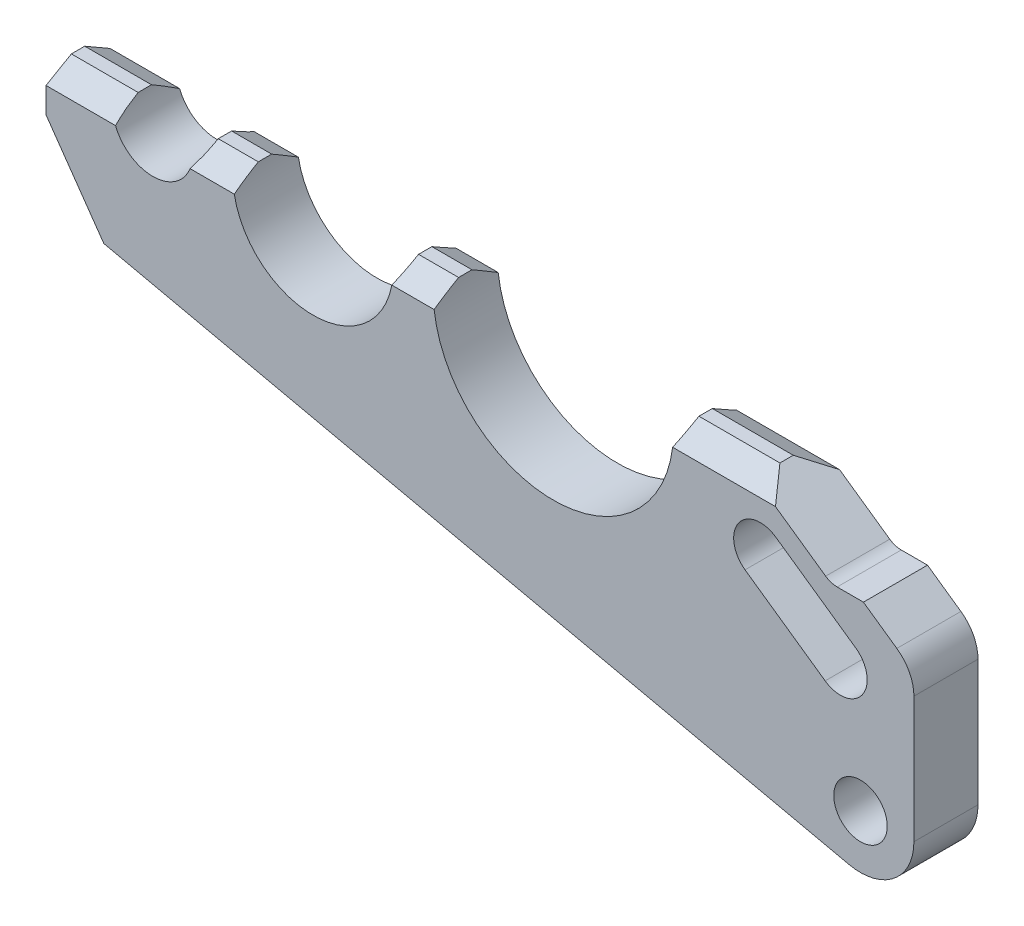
ISO-10303-21;
HEADER;
FILE_DESCRIPTION(('STEP AP214'),'2;1');
FILE_NAME('part.step','',(''),(''),'','','');
FILE_SCHEMA(('AUTOMOTIVE_DESIGN { 1 0 10303 214 1 1 1 1 }'));
ENDSEC;
DATA;
#1=APPLICATION_CONTEXT('core data for automotive mechanical design processes');
#2=APPLICATION_PROTOCOL_DEFINITION('international standard','automotive_design',2000,#1);
#3=PRODUCT_CONTEXT('',#1,'mechanical');
#4=PRODUCT('Part','Part','',(#3));
#5=PRODUCT_RELATED_PRODUCT_CATEGORY('part','',(#4));
#6=PRODUCT_DEFINITION_FORMATION('','',#4);
#7=PRODUCT_DEFINITION_CONTEXT('part definition',#1,'design');
#8=PRODUCT_DEFINITION('design','',#6,#7);
#9=PRODUCT_DEFINITION_SHAPE('','',#8);
#10=(LENGTH_UNIT() NAMED_UNIT(*) SI_UNIT(.MILLI.,.METRE.));
#11=(NAMED_UNIT(*) PLANE_ANGLE_UNIT() SI_UNIT($,.RADIAN.));
#12=(NAMED_UNIT(*) SI_UNIT($,.STERADIAN.) SOLID_ANGLE_UNIT());
#13=UNCERTAINTY_MEASURE_WITH_UNIT(LENGTH_MEASURE(1.E-05),#10,'distance_accuracy_value','');
#14=(GEOMETRIC_REPRESENTATION_CONTEXT(3) GLOBAL_UNCERTAINTY_ASSIGNED_CONTEXT((#13)) GLOBAL_UNIT_ASSIGNED_CONTEXT((#10,
#11,#12)) REPRESENTATION_CONTEXT('',''));
#15=CARTESIAN_POINT('',(0.,0.,0.));
#16=DIRECTION('',(0.,0.,1.));
#17=DIRECTION('',(1.,0.,0.));
#18=AXIS2_PLACEMENT_3D('',#15,#16,#17);
#19=CARTESIAN_POINT('',(90.202718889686,50.4587103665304,-4.79999999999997));
#20=DIRECTION('',(0.,0.,1.));
#21=DIRECTION('',(1.,0.,0.));
#22=AXIS2_PLACEMENT_3D('',#19,#20,#21);
#23=CYLINDRICAL_SURFACE('',#22,2.);
#24=CARTESIAN_POINT('',(90.202718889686,50.4587103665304,0.));
#25=DIRECTION('',(0.,0.,1.));
#26=DIRECTION('',(1.,0.,0.));
#27=AXIS2_PLACEMENT_3D('',#24,#25,#26);
#28=CIRCLE('',#27,2.);
#29=CARTESIAN_POINT('',(89.0555660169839,48.8204062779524,0.));
#30=VERTEX_POINT('',#29);
#31=CARTESIAN_POINT('',(91.3498717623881,52.0970144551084,0.));
#32=VERTEX_POINT('',#31);
#33=EDGE_CURVE('E365',#30,#32,#28,.T.);
#34=ORIENTED_EDGE('',*,*,#33,.T.);
#35=DIRECTION('',(0.,0.,1.));
#36=VECTOR('',#35,1.);
#37=CARTESIAN_POINT('',(91.3498717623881,52.0970144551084,-4.79999999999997));
#38=LINE('',#37,#36);
#39=CARTESIAN_POINT('',(91.3498717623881,52.0970144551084,-4.79999999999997));
#40=VERTEX_POINT('',#39);
#41=EDGE_CURVE('E377',#40,#32,#38,.T.);
#42=ORIENTED_EDGE('',*,*,#41,.F.);
#43=CARTESIAN_POINT('',(90.202718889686,50.4587103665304,-4.79999999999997));
#44=DIRECTION('',(0.,0.,1.));
#45=DIRECTION('',(1.,0.,0.));
#46=AXIS2_PLACEMENT_3D('',#43,#44,#45);
#47=CIRCLE('',#46,2.);
#48=CARTESIAN_POINT('',(89.0555660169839,48.8204062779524,-4.79999999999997));
#49=VERTEX_POINT('',#48);
#50=EDGE_CURVE('E315',#49,#40,#47,.T.);
#51=ORIENTED_EDGE('',*,*,#50,.F.);
#52=DIRECTION('',(0.,0.,1.));
#53=VECTOR('',#52,1.);
#54=CARTESIAN_POINT('',(89.0555660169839,48.8204062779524,-4.79999999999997));
#55=LINE('',#54,#53);
#56=EDGE_CURVE('E385',#49,#30,#55,.T.);
#57=ORIENTED_EDGE('',*,*,#56,.T.);
#58=EDGE_LOOP('',(#34,#42,#51,#57));
#59=FACE_BOUND('',#58,.T.);
#60=ADVANCED_FACE('F36',(#59),#23,.F.);
#61=CARTESIAN_POINT('',(54.5307777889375,77.8780216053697,-4.79999999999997));
#62=DIRECTION('',(-0.573576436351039,-0.819152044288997,0.));
#63=DIRECTION('',(0.819152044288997,-0.573576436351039,0.));
#64=AXIS2_PLACEMENT_3D('',#61,#62,#63);
#65=PLANE('',#64);
#66=DIRECTION('',(0.819152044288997,-0.573576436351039,0.));
#67=VECTOR('',#66,1.);
#68=CARTESIAN_POINT('',(54.5307777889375,77.8780216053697,0.));
#69=LINE('',#68,#67);
#70=CARTESIAN_POINT('',(85.3498717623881,56.2982596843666,0.));
#71=VERTEX_POINT('',#70);
#72=EDGE_CURVE('E372',#71,#32,#69,.T.);
#73=ORIENTED_EDGE('',*,*,#72,.F.);
#74=DIRECTION('',(0.,0.,1.));
#75=VECTOR('',#74,1.);
#76=CARTESIAN_POINT('',(85.3498717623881,56.2982596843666,-4.79999999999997));
#77=LINE('',#76,#75);
#78=CARTESIAN_POINT('',(85.3498717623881,56.2982596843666,-4.79999999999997));
#79=VERTEX_POINT('',#78);
#80=EDGE_CURVE('E380',#79,#71,#77,.T.);
#81=ORIENTED_EDGE('',*,*,#80,.F.);
#82=DIRECTION('',(0.819152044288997,-0.573576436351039,0.));
#83=VECTOR('',#82,1.);
#84=CARTESIAN_POINT('',(54.5307777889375,77.8780216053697,-4.79999999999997));
#85=LINE('',#84,#83);
#86=EDGE_CURVE('E321',#79,#40,#85,.T.);
#87=ORIENTED_EDGE('',*,*,#86,.T.);
#88=ORIENTED_EDGE('',*,*,#41,.T.);
#89=EDGE_LOOP('',(#73,#81,#87,#88));
#90=FACE_BOUND('',#89,.T.);
#91=ADVANCED_FACE('F503',(#90),#65,.T.);
#92=CARTESIAN_POINT('',(84.202718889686,54.6599555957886,-4.79999999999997));
#93=DIRECTION('',(0.,0.,1.));
#94=DIRECTION('',(1.,0.,0.));
#95=AXIS2_PLACEMENT_3D('',#92,#93,#94);
#96=CYLINDRICAL_SURFACE('',#95,2.);
#97=CARTESIAN_POINT('',(84.202718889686,54.6599555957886,0.));
#98=DIRECTION('',(0.,0.,1.));
#99=DIRECTION('',(1.,0.,0.));
#100=AXIS2_PLACEMENT_3D('',#97,#98,#99);
#101=CIRCLE('',#100,2.);
#102=CARTESIAN_POINT('',(83.0555660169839,53.0216515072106,0.));
#103=VERTEX_POINT('',#102);
#104=EDGE_CURVE('E370',#71,#103,#101,.T.);
#105=ORIENTED_EDGE('',*,*,#104,.T.);
#106=DIRECTION('',(0.,0.,1.));
#107=VECTOR('',#106,1.);
#108=CARTESIAN_POINT('',(83.0555660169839,53.0216515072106,-4.79999999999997));
#109=LINE('',#108,#107);
#110=CARTESIAN_POINT('',(83.0555660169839,53.0216515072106,-4.79999999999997));
#111=VERTEX_POINT('',#110);
#112=EDGE_CURVE('E382',#111,#103,#109,.T.);
#113=ORIENTED_EDGE('',*,*,#112,.F.);
#114=CARTESIAN_POINT('',(84.202718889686,54.6599555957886,-4.79999999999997));
#115=DIRECTION('',(0.,0.,1.));
#116=DIRECTION('',(1.,0.,0.));
#117=AXIS2_PLACEMENT_3D('',#114,#115,#116);
#118=CIRCLE('',#117,2.);
#119=EDGE_CURVE('E319',#79,#111,#118,.T.);
#120=ORIENTED_EDGE('',*,*,#119,.F.);
#121=ORIENTED_EDGE('',*,*,#80,.T.);
#122=EDGE_LOOP('',(#105,#113,#120,#121));
#123=FACE_BOUND('',#122,.T.);
#124=ADVANCED_FACE('F509',(#123),#96,.F.);
#125=CARTESIAN_POINT('',(89.954150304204,56.8587103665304,-4.79999999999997));
#126=DIRECTION('',(0.,0.,1.));
#127=DIRECTION('',(1.,0.,0.));
#128=AXIS2_PLACEMENT_3D('',#125,#126,#127);
#129=CYLINDRICAL_SURFACE('',#128,1.5);
#130=CARTESIAN_POINT('',(89.954150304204,56.8587103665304,0.));
#131=DIRECTION('',(0.,0.,1.));
#132=DIRECTION('',(1.,0.,0.));
#133=AXIS2_PLACEMENT_3D('',#130,#131,#132);
#134=CIRCLE('',#133,1.5);
#135=CARTESIAN_POINT('',(89.0937856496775,55.6299823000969,0.));
#136=VERTEX_POINT('',#135);
#137=CARTESIAN_POINT('',(89.954150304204,55.3587103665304,0.));
#138=VERTEX_POINT('',#137);
#139=EDGE_CURVE('E328',#136,#138,#134,.T.);
#140=ORIENTED_EDGE('',*,*,#139,.T.);
#141=DIRECTION('',(0.,0.,1.));
#142=VECTOR('',#141,1.);
#143=CARTESIAN_POINT('',(89.954150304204,55.3587103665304,-4.79999999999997));
#144=LINE('',#143,#142);
#145=CARTESIAN_POINT('',(89.954150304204,55.3587103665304,-4.79999999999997));
#146=VERTEX_POINT('',#145);
#147=EDGE_CURVE('E388',#146,#138,#144,.T.);
#148=ORIENTED_EDGE('',*,*,#147,.F.);
#149=CARTESIAN_POINT('',(89.954150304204,56.8587103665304,-4.79999999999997));
#150=DIRECTION('',(0.,0.,1.));
#151=DIRECTION('',(1.,0.,0.));
#152=AXIS2_PLACEMENT_3D('',#149,#150,#151);
#153=CIRCLE('',#152,1.5);
#154=CARTESIAN_POINT('',(89.0937856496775,55.6299823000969,-4.79999999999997));
#155=VERTEX_POINT('',#154);
#156=EDGE_CURVE('E287',#155,#146,#153,.T.);
#157=ORIENTED_EDGE('',*,*,#156,.F.);
#158=DIRECTION('',(0.,0.,1.));
#159=VECTOR('',#158,1.);
#160=CARTESIAN_POINT('',(89.0937856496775,55.6299823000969,-4.79999999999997));
#161=LINE('',#160,#159);
#162=EDGE_CURVE('E327',#155,#136,#161,.T.);
#163=ORIENTED_EDGE('',*,*,#162,.T.);
#164=EDGE_LOOP('',(#140,#148,#157,#163));
#165=FACE_BOUND('',#164,.T.);
#166=ADVANCED_FACE('F38',(#165),#129,.F.);
#167=CARTESIAN_POINT('',(-3.90398539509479E-13,55.3587103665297,-4.79999999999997));
#168=DIRECTION('',(0.,1.,0.));
#169=DIRECTION('',(-1.,0.,0.));
#170=AXIS2_PLACEMENT_3D('',#167,#168,#169);
#171=PLANE('',#170);
#172=DIRECTION('',(-1.,0.,0.));
#173=VECTOR('',#172,1.);
#174=CARTESIAN_POINT('',(-3.90398539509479E-13,55.3587103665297,0.));
#175=LINE('',#174,#173);
#176=CARTESIAN_POINT('',(91.9220276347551,55.3587103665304,0.));
#177=VERTEX_POINT('',#176);
#178=EDGE_CURVE('E362',#177,#138,#175,.T.);
#179=ORIENTED_EDGE('',*,*,#178,.F.);
#180=DIRECTION('',(0.,0.,1.));
#181=VECTOR('',#180,1.);
#182=CARTESIAN_POINT('',(91.9220276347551,55.3587103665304,-4.79999999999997));
#183=LINE('',#182,#181);
#184=CARTESIAN_POINT('',(91.9220276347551,55.3587103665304,-4.79999999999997));
#185=VERTEX_POINT('',#184);
#186=EDGE_CURVE('E390',#185,#177,#183,.T.);
#187=ORIENTED_EDGE('',*,*,#186,.F.);
#188=DIRECTION('',(-1.,0.,0.));
#189=VECTOR('',#188,1.);
#190=CARTESIAN_POINT('',(-3.90398539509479E-13,55.3587103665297,-4.79999999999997));
#191=LINE('',#190,#189);
#192=EDGE_CURVE('E312',#185,#146,#191,.T.);
#193=ORIENTED_EDGE('',*,*,#192,.T.);
#194=ORIENTED_EDGE('',*,*,#147,.T.);
#195=EDGE_LOOP('',(#179,#187,#193,#194));
#196=FACE_BOUND('',#195,.T.);
#197=ADVANCED_FACE('F516',(#196),#171,.T.);
#198=CARTESIAN_POINT('',(56.2515070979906,80.3354777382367,-4.79999999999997));
#199=DIRECTION('',(0.573576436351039,0.819152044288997,0.));
#200=DIRECTION('',(-0.819152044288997,0.573576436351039,0.));
#201=AXIS2_PLACEMENT_3D('',#198,#199,#200);
#202=PLANE('',#201);
#203=DIRECTION('',(-0.819152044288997,0.573576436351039,0.));
#204=VECTOR('',#203,1.);
#205=CARTESIAN_POINT('',(56.2515070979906,80.3354777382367,0.));
#206=LINE('',#205,#204);
#207=CARTESIAN_POINT('',(94.4234481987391,53.607196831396,0.));
#208=VERTEX_POINT('',#207);
#209=EDGE_CURVE('E359',#208,#177,#206,.T.);
#210=ORIENTED_EDGE('',*,*,#209,.F.);
#211=DIRECTION('',(0.,0.,1.));
#212=VECTOR('',#211,1.);
#213=CARTESIAN_POINT('',(94.4234481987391,53.607196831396,-4.79999999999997));
#214=LINE('',#213,#212);
#215=CARTESIAN_POINT('',(94.4234481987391,53.607196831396,-4.79999999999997));
#216=VERTEX_POINT('',#215);
#217=EDGE_CURVE('E392',#216,#208,#214,.T.);
#218=ORIENTED_EDGE('',*,*,#217,.F.);
#219=DIRECTION('',(-0.819152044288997,0.573576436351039,0.));
#220=VECTOR('',#219,1.);
#221=CARTESIAN_POINT('',(56.2515070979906,80.3354777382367,-4.79999999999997));
#222=LINE('',#221,#220);
#223=EDGE_CURVE('E309',#216,#185,#222,.T.);
#224=ORIENTED_EDGE('',*,*,#223,.T.);
#225=ORIENTED_EDGE('',*,*,#186,.T.);
#226=EDGE_LOOP('',(#210,#218,#224,#225));
#227=FACE_BOUND('',#226,.T.);
#228=ADVANCED_FACE('F519',(#227),#202,.T.);
#229=CARTESIAN_POINT('',(92.702718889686,51.1497406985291,-4.79999999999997));
#230=DIRECTION('',(0.,0.,1.));
#231=DIRECTION('',(1.,0.,0.));
#232=AXIS2_PLACEMENT_3D('',#229,#230,#231);
#233=CYLINDRICAL_SURFACE('',#232,3.00000000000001);
#234=CARTESIAN_POINT('',(92.702718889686,51.1497406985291,0.));
#235=DIRECTION('',(0.,0.,1.));
#236=DIRECTION('',(1.,0.,0.));
#237=AXIS2_PLACEMENT_3D('',#234,#235,#236);
#238=CIRCLE('',#237,3.00000000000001);
#239=CARTESIAN_POINT('',(95.702718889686,51.1497406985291,0.));
#240=VERTEX_POINT('',#239);
#241=EDGE_CURVE('E356',#240,#208,#238,.T.);
#242=ORIENTED_EDGE('',*,*,#241,.F.);
#243=DIRECTION('',(0.,0.,1.));
#244=VECTOR('',#243,1.);
#245=CARTESIAN_POINT('',(95.702718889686,51.1497406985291,-4.79999999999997));
#246=LINE('',#245,#244);
#247=CARTESIAN_POINT('',(95.702718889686,51.1497406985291,-4.79999999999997));
#248=VERTEX_POINT('',#247);
#249=EDGE_CURVE('E394',#248,#240,#246,.T.);
#250=ORIENTED_EDGE('',*,*,#249,.F.);
#251=CARTESIAN_POINT('',(92.702718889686,51.1497406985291,-4.79999999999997));
#252=DIRECTION('',(0.,0.,1.));
#253=DIRECTION('',(1.,0.,0.));
#254=AXIS2_PLACEMENT_3D('',#251,#252,#253);
#255=CIRCLE('',#254,3.00000000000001);
#256=EDGE_CURVE('E306',#248,#216,#255,.T.);
#257=ORIENTED_EDGE('',*,*,#256,.T.);
#258=ORIENTED_EDGE('',*,*,#217,.T.);
#259=EDGE_LOOP('',(#242,#250,#257,#258));
#260=FACE_BOUND('',#259,.T.);
#261=ADVANCED_FACE('F523',(#260),#233,.T.);
#262=CARTESIAN_POINT('',(95.7027188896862,4.22032970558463E-13,-4.79999999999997));
#263=DIRECTION('',(1.,0.,0.));
#264=DIRECTION('',(0.,1.,0.));
#265=AXIS2_PLACEMENT_3D('',#262,#263,#264);
#266=PLANE('',#265);
#267=DIRECTION('',(0.,1.,0.));
#268=VECTOR('',#267,1.);
#269=CARTESIAN_POINT('',(95.7027188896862,4.22032970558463E-13,0.));
#270=LINE('',#269,#268);
#271=CARTESIAN_POINT('',(95.702718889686,41.7087103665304,0.));
#272=VERTEX_POINT('',#271);
#273=EDGE_CURVE('E353',#272,#240,#270,.T.);
#274=ORIENTED_EDGE('',*,*,#273,.F.);
#275=DIRECTION('',(0.,0.,1.));
#276=VECTOR('',#275,1.);
#277=CARTESIAN_POINT('',(95.702718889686,41.7087103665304,-4.79999999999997));
#278=LINE('',#277,#276);
#279=CARTESIAN_POINT('',(95.702718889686,41.7087103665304,-4.79999999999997));
#280=VERTEX_POINT('',#279);
#281=EDGE_CURVE('E396',#280,#272,#278,.T.);
#282=ORIENTED_EDGE('',*,*,#281,.F.);
#283=DIRECTION('',(0.,1.,0.));
#284=VECTOR('',#283,1.);
#285=CARTESIAN_POINT('',(95.7027188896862,4.22032970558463E-13,-4.79999999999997));
#286=LINE('',#285,#284);
#287=EDGE_CURVE('E303',#280,#248,#286,.T.);
#288=ORIENTED_EDGE('',*,*,#287,.T.);
#289=ORIENTED_EDGE('',*,*,#249,.T.);
#290=EDGE_LOOP('',(#274,#282,#288,#289));
#291=FACE_BOUND('',#290,.T.);
#292=ADVANCED_FACE('F527',(#291),#266,.T.);
#293=CARTESIAN_POINT('',(91.702718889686,41.7087103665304,-4.79999999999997));
#294=DIRECTION('',(0.,0.,1.));
#295=DIRECTION('',(1.,0.,0.));
#296=AXIS2_PLACEMENT_3D('',#293,#294,#295);
#297=CYLINDRICAL_SURFACE('',#296,4.);
#298=ORIENTED_EDGE('',*,*,#281,.T.);
#299=CARTESIAN_POINT('',(91.702718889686,41.7087103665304,0.));
#300=DIRECTION('',(0.,0.,1.));
#301=DIRECTION('',(1.,0.,0.));
#302=AXIS2_PLACEMENT_3D('',#299,#300,#301);
#303=CIRCLE('',#302,4.);
#304=CARTESIAN_POINT('',(90.8369604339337,37.8035263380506,0.));
#305=VERTEX_POINT('',#304);
#306=EDGE_CURVE('E351',#305,#272,#303,.T.);
#307=ORIENTED_EDGE('',*,*,#306,.F.);
#308=DIRECTION('',(0.,0.,1.));
#309=VECTOR('',#308,1.);
#310=CARTESIAN_POINT('',(90.8369604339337,37.8035263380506,-4.79999999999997));
#311=LINE('',#310,#309);
#312=CARTESIAN_POINT('',(90.8369604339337,37.8035263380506,-4.79999999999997));
#313=VERTEX_POINT('',#312);
#314=EDGE_CURVE('E399',#313,#305,#311,.T.);
#315=ORIENTED_EDGE('',*,*,#314,.F.);
#316=CARTESIAN_POINT('',(91.702718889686,41.7087103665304,-4.79999999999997));
#317=DIRECTION('',(0.,0.,1.));
#318=DIRECTION('',(1.,0.,0.));
#319=AXIS2_PLACEMENT_3D('',#316,#317,#318);
#320=CIRCLE('',#319,4.);
#321=EDGE_CURVE('E301',#313,#280,#320,.T.);
#322=ORIENTED_EDGE('',*,*,#321,.T.);
#323=EDGE_LOOP('',(#298,#307,#315,#322));
#324=FACE_BOUND('',#323,.T.);
#325=ADVANCED_FACE('F531',(#324),#297,.T.);
#326=CARTESIAN_POINT('',(12.2435882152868,55.2272574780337,-4.79999999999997));
#327=DIRECTION('',(-0.216439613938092,-0.976296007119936,0.));
#328=DIRECTION('',(0.976296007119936,-0.216439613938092,0.));
#329=AXIS2_PLACEMENT_3D('',#326,#327,#328);
#330=PLANE('',#329);
#331=DIRECTION('',(0.976296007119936,-0.216439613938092,0.));
#332=VECTOR('',#331,1.);
#333=CARTESIAN_POINT('',(12.2435882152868,55.2272574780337,0.));
#334=LINE('',#333,#332);
#335=CARTESIAN_POINT('',(35.0325536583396,50.1750654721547,0.));
#336=VERTEX_POINT('',#335);
#337=EDGE_CURVE('E348',#336,#305,#334,.T.);
#338=ORIENTED_EDGE('',*,*,#337,.F.);
#339=DIRECTION('',(0.,0.,1.));
#340=VECTOR('',#339,1.);
#341=CARTESIAN_POINT('',(35.0325536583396,50.1750654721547,-4.79999999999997));
#342=LINE('',#341,#340);
#343=CARTESIAN_POINT('',(35.0325536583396,50.1750654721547,-4.79999999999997));
#344=VERTEX_POINT('',#343);
#345=EDGE_CURVE('E401',#344,#336,#342,.T.);
#346=ORIENTED_EDGE('',*,*,#345,.F.);
#347=DIRECTION('',(0.976296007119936,-0.216439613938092,0.));
#348=VECTOR('',#347,1.);
#349=CARTESIAN_POINT('',(12.2435882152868,55.2272574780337,-4.79999999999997));
#350=LINE('',#349,#348);
#351=EDGE_CURVE('E298',#344,#313,#350,.T.);
#352=ORIENTED_EDGE('',*,*,#351,.T.);
#353=ORIENTED_EDGE('',*,*,#314,.T.);
#354=EDGE_LOOP('',(#338,#346,#352,#353));
#355=FACE_BOUND('',#354,.T.);
#356=ADVANCED_FACE('F535',(#355),#330,.T.);
#357=CARTESIAN_POINT('',(47.0817657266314,32.9670072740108,-4.79999999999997));
#358=DIRECTION('',(-0.819152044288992,-0.573576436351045,0.));
#359=DIRECTION('',(0.573576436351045,-0.819152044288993,0.));
#360=AXIS2_PLACEMENT_3D('',#357,#358,#359);
#361=PLANE('',#360);
#362=DIRECTION('',(0.573576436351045,-0.819152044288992,0.));
#363=VECTOR('',#362,1.);
#364=CARTESIAN_POINT('',(47.0817657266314,32.9670072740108,0.));
#365=LINE('',#364,#363);
#366=CARTESIAN_POINT('',(30.702718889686,56.3587103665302,0.));
#367=VERTEX_POINT('',#366);
#368=EDGE_CURVE('E345',#367,#336,#365,.T.);
#369=ORIENTED_EDGE('',*,*,#368,.F.);
#370=DIRECTION('',(0.,0.,1.));
#371=VECTOR('',#370,1.);
#372=CARTESIAN_POINT('',(30.702718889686,56.3587103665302,-4.79999999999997));
#373=LINE('',#372,#371);
#374=CARTESIAN_POINT('',(30.702718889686,56.3587103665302,-4.79999999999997));
#375=VERTEX_POINT('',#374);
#376=EDGE_CURVE('E403',#375,#367,#373,.T.);
#377=ORIENTED_EDGE('',*,*,#376,.F.);
#378=DIRECTION('',(0.573576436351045,-0.819152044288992,0.));
#379=VECTOR('',#378,1.);
#380=CARTESIAN_POINT('',(47.0817657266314,32.9670072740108,-4.79999999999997));
#381=LINE('',#380,#379);
#382=EDGE_CURVE('E239',#375,#344,#381,.T.);
#383=ORIENTED_EDGE('',*,*,#382,.T.);
#384=ORIENTED_EDGE('',*,*,#345,.T.);
#385=EDGE_LOOP('',(#369,#377,#383,#384));
#386=FACE_BOUND('',#385,.T.);
#387=ADVANCED_FACE('F539',(#386),#361,.T.);
#388=CARTESIAN_POINT('',(30.7027188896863,1.84500571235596E-13,-4.79999999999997));
#389=DIRECTION('',(1.,0.,0.));
#390=DIRECTION('',(0.,1.,0.));
#391=AXIS2_PLACEMENT_3D('',#388,#389,#390);
#392=PLANE('',#391);
#393=DIRECTION('',(0.,-0.5,0.866025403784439));
#394=VECTOR('',#393,1.);
#395=CARTESIAN_POINT('',(30.702718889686,59.3587103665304,-1.90000000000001));
#396=LINE('',#395,#394);
#397=CARTESIAN_POINT('',(30.702718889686,59.3587103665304,-1.90000000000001));
#398=VERTEX_POINT('',#397);
#399=CARTESIAN_POINT('',(30.702718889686,58.2617448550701,0.));
#400=VERTEX_POINT('',#399);
#401=EDGE_CURVE('E250',#398,#400,#396,.T.);
#402=ORIENTED_EDGE('',*,*,#401,.F.);
#403=DIRECTION('',(0.,0.,1.));
#404=VECTOR('',#403,1.);
#405=CARTESIAN_POINT('',(30.702718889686,59.3587103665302,-4.79999999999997));
#406=LINE('',#405,#404);
#407=CARTESIAN_POINT('',(30.702718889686,59.3587103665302,-2.90000000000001));
#408=VERTEX_POINT('',#407);
#409=EDGE_CURVE('E247',#408,#398,#406,.T.);
#410=ORIENTED_EDGE('',*,*,#409,.F.);
#411=DIRECTION('',(0.,0.5,0.866025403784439));
#412=VECTOR('',#411,1.);
#413=CARTESIAN_POINT('',(30.702718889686,58.2617448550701,-4.80000000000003));
#414=LINE('',#413,#412);
#415=CARTESIAN_POINT('',(30.702718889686,58.2617448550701,-4.80000000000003));
#416=VERTEX_POINT('',#415);
#417=EDGE_CURVE('E244',#416,#408,#414,.T.);
#418=ORIENTED_EDGE('',*,*,#417,.F.);
#419=DIRECTION('',(0.,1.,0.));
#420=VECTOR('',#419,1.);
#421=CARTESIAN_POINT('',(30.7027188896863,1.84500571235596E-13,-4.79999999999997));
#422=LINE('',#421,#420);
#423=EDGE_CURVE('E231',#375,#416,#422,.T.);
#424=ORIENTED_EDGE('',*,*,#423,.F.);
#425=ORIENTED_EDGE('',*,*,#376,.T.);
#426=DIRECTION('',(0.,1.,0.));
#427=VECTOR('',#426,1.);
#428=CARTESIAN_POINT('',(30.7027188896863,1.84500571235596E-13,0.));
#429=LINE('',#428,#427);
#430=EDGE_CURVE('E342',#367,#400,#429,.T.);
#431=ORIENTED_EDGE('',*,*,#430,.T.);
#432=EDGE_LOOP('',(#402,#410,#418,#424,#425,#431));
#433=FACE_BOUND('',#432,.T.);
#434=ADVANCED_FACE('F246',(#433),#392,.F.);
#435=CARTESIAN_POINT('',(-2.47130276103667E-13,59.35871036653,-4.79999999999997));
#436=DIRECTION('',(0.,-1.,0.));
#437=DIRECTION('',(1.,0.,0.));
#438=AXIS2_PLACEMENT_3D('',#435,#436,#437);
#439=PLANE('',#438);
#440=DIRECTION('',(1.,0.,0.));
#441=VECTOR('',#440,1.);
#442=CARTESIAN_POINT('',(30.702718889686,59.3587103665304,-1.90000000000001));
#443=LINE('',#442,#441);
#444=CARTESIAN_POINT('',(35.702718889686,59.3587103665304,-1.90000000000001));
#445=VERTEX_POINT('',#444);
#446=EDGE_CURVE('E264',#398,#445,#443,.T.);
#447=ORIENTED_EDGE('',*,*,#446,.T.);
#448=DIRECTION('',(0.,0.,1.));
#449=VECTOR('',#448,1.);
#450=CARTESIAN_POINT('',(35.702718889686,59.3587103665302,-4.79999999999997));
#451=LINE('',#450,#449);
#452=CARTESIAN_POINT('',(35.702718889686,59.3587103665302,-2.90000000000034));
#453=VERTEX_POINT('',#452);
#454=EDGE_CURVE('E406',#453,#445,#451,.T.);
#455=ORIENTED_EDGE('',*,*,#454,.F.);
#456=DIRECTION('',(1.,0.,0.));
#457=VECTOR('',#456,1.);
#458=CARTESIAN_POINT('',(30.702718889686,59.3587103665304,-2.90000000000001));
#459=LINE('',#458,#457);
#460=EDGE_CURVE('E52',#408,#453,#459,.T.);
#461=ORIENTED_EDGE('',*,*,#460,.F.);
#462=ORIENTED_EDGE('',*,*,#409,.T.);
#463=EDGE_LOOP('',(#447,#455,#461,#462));
#464=FACE_BOUND('',#463,.T.);
#465=ADVANCED_FACE('F450',(#464),#439,.F.);
#466=CARTESIAN_POINT('',(38.702718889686,59.3587103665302,-4.79999999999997));
#467=DIRECTION('',(0.,0.,1.));
#468=DIRECTION('',(1.,0.,0.));
#469=AXIS2_PLACEMENT_3D('',#466,#467,#468);
#470=CYLINDRICAL_SURFACE('',#469,3.00000000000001);
#471=CARTESIAN_POINT('',(38.702718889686,59.3587103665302,-1.8999999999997));
#472=DIRECTION('',(0.,0.866025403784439,0.5));
#473=DIRECTION('',(0.,-0.5,0.866025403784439));
#474=AXIS2_PLACEMENT_3D('',#471,#472,#473);
#475=ELLIPSE('',#474,6.00000000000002,3.00000000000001);
#476=CARTESIAN_POINT('',(35.9104677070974,58.2617448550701,0.));
#477=VERTEX_POINT('',#476);
#478=EDGE_CURVE('E272',#477,#445,#475,.F.);
#479=ORIENTED_EDGE('',*,*,#478,.F.);
#480=CARTESIAN_POINT('',(38.702718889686,59.3587103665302,0.));
#481=DIRECTION('',(0.,0.,1.));
#482=DIRECTION('',(1.,0.,0.));
#483=AXIS2_PLACEMENT_3D('',#480,#481,#482);
#484=CIRCLE('',#483,3.00000000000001);
#485=CARTESIAN_POINT('',(41.4949700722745,58.2617448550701,0.));
#486=VERTEX_POINT('',#485);
#487=EDGE_CURVE('E339',#477,#486,#484,.T.);
#488=ORIENTED_EDGE('',*,*,#487,.T.);
#489=CARTESIAN_POINT('',(41.702718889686,59.3587103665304,-1.90000000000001));
#490=VERTEX_POINT('',#489);
#491=EDGE_CURVE('E270',#490,#486,#475,.F.);
#492=ORIENTED_EDGE('',*,*,#491,.F.);
#493=DIRECTION('',(0.,0.,1.));
#494=VECTOR('',#493,1.);
#495=CARTESIAN_POINT('',(41.702718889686,59.3587103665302,-4.79999999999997));
#496=LINE('',#495,#494);
#497=CARTESIAN_POINT('',(41.702718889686,59.3587103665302,-2.9000000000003));
#498=VERTEX_POINT('',#497);
#499=EDGE_CURVE('E408',#498,#490,#496,.T.);
#500=ORIENTED_EDGE('',*,*,#499,.F.);
#501=CARTESIAN_POINT('',(38.702718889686,59.3587103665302,-2.90000000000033));
#502=DIRECTION('',(0.,0.866025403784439,-0.5));
#503=DIRECTION('',(0.,0.5,0.866025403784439));
#504=AXIS2_PLACEMENT_3D('',#501,#502,#503);
#505=ELLIPSE('',#504,6.00000000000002,3.00000000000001);
#506=CARTESIAN_POINT('',(41.4949700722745,58.2617448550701,-4.80000000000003));
#507=VERTEX_POINT('',#506);
#508=EDGE_CURVE('E284',#507,#498,#505,.F.);
#509=ORIENTED_EDGE('',*,*,#508,.F.);
#510=CARTESIAN_POINT('',(38.702718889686,59.3587103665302,-4.79999999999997));
#511=DIRECTION('',(0.,0.,1.));
#512=DIRECTION('',(1.,0.,0.));
#513=AXIS2_PLACEMENT_3D('',#510,#511,#512);
#514=CIRCLE('',#513,3.00000000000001);
#515=CARTESIAN_POINT('',(35.9104677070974,58.2617448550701,-4.79999999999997));
#516=VERTEX_POINT('',#515);
#517=EDGE_CURVE('E241',#516,#507,#514,.T.);
#518=ORIENTED_EDGE('',*,*,#517,.F.);
#519=EDGE_CURVE('E60',#453,#516,#505,.F.);
#520=ORIENTED_EDGE('',*,*,#519,.F.);
#521=ORIENTED_EDGE('',*,*,#454,.T.);
#522=EDGE_LOOP('',(#479,#488,#492,#500,#509,#518,#520,#521));
#523=FACE_BOUND('',#522,.T.);
#524=ADVANCED_FACE('F445',(#523),#470,.F.);
#525=CARTESIAN_POINT('',(-1.3729459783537E-13,59.3587103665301,-4.79999999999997));
#526=DIRECTION('',(0.,-1.,0.));
#527=DIRECTION('',(1.,0.,0.));
#528=AXIS2_PLACEMENT_3D('',#525,#526,#527);
#529=PLANE('',#528);
#530=CARTESIAN_POINT('',(44.702718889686,59.3587103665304,-1.90000000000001));
#531=VERTEX_POINT('',#530);
#532=EDGE_CURVE('E451',#490,#531,#443,.T.);
#533=ORIENTED_EDGE('',*,*,#532,.T.);
#534=DIRECTION('',(0.,0.,1.));
#535=VECTOR('',#534,1.);
#536=CARTESIAN_POINT('',(44.702718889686,59.3587103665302,-4.79999999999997));
#537=LINE('',#536,#535);
#538=CARTESIAN_POINT('',(44.702718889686,59.3587103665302,-2.90000000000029));
#539=VERTEX_POINT('',#538);
#540=EDGE_CURVE('E411',#539,#531,#537,.T.);
#541=ORIENTED_EDGE('',*,*,#540,.F.);
#542=EDGE_CURVE('E459',#498,#539,#459,.T.);
#543=ORIENTED_EDGE('',*,*,#542,.F.);
#544=ORIENTED_EDGE('',*,*,#499,.T.);
#545=EDGE_LOOP('',(#533,#541,#543,#544));
#546=FACE_BOUND('',#545,.T.);
#547=ADVANCED_FACE('F491',(#546),#529,.F.);
#548=CARTESIAN_POINT('',(50.702718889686,59.3587103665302,-4.79999999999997));
#549=DIRECTION('',(0.,0.,1.));
#550=DIRECTION('',(1.,0.,0.));
#551=AXIS2_PLACEMENT_3D('',#548,#549,#550);
#552=CYLINDRICAL_SURFACE('',#551,6.);
#553=CARTESIAN_POINT('',(50.702718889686,59.3587103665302,-1.89999999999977));
#554=DIRECTION('',(0.,0.866025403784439,0.5));
#555=DIRECTION('',(0.,-0.5,0.866025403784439));
#556=AXIS2_PLACEMENT_3D('',#553,#554,#555);
#557=ELLIPSE('',#556,12.,6.);
#558=CARTESIAN_POINT('',(44.8038489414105,58.2617448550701,0.));
#559=VERTEX_POINT('',#558);
#560=EDGE_CURVE('E269',#559,#531,#557,.F.);
#561=ORIENTED_EDGE('',*,*,#560,.F.);
#562=CARTESIAN_POINT('',(50.702718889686,59.3587103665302,0.));
#563=DIRECTION('',(0.,0.,1.));
#564=DIRECTION('',(1.,0.,0.));
#565=AXIS2_PLACEMENT_3D('',#562,#563,#564);
#566=CIRCLE('',#565,6.);
#567=CARTESIAN_POINT('',(56.6015888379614,58.2617448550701,0.));
#568=VERTEX_POINT('',#567);
#569=EDGE_CURVE('E336',#559,#568,#566,.T.);
#570=ORIENTED_EDGE('',*,*,#569,.T.);
#571=CARTESIAN_POINT('',(56.702718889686,59.3587103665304,-1.90000000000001));
#572=VERTEX_POINT('',#571);
#573=EDGE_CURVE('E267',#572,#568,#557,.F.);
#574=ORIENTED_EDGE('',*,*,#573,.F.);
#575=DIRECTION('',(0.,0.,1.));
#576=VECTOR('',#575,1.);
#577=CARTESIAN_POINT('',(56.702718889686,59.3587103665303,-4.79999999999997));
#578=LINE('',#577,#576);
#579=CARTESIAN_POINT('',(56.702718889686,59.3587103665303,-2.9000000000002));
#580=VERTEX_POINT('',#579);
#581=EDGE_CURVE('E414',#580,#572,#578,.T.);
#582=ORIENTED_EDGE('',*,*,#581,.F.);
#583=CARTESIAN_POINT('',(50.702718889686,59.3587103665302,-2.90000000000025));
#584=DIRECTION('',(0.,0.866025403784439,-0.5));
#585=DIRECTION('',(0.,0.5,0.866025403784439));
#586=AXIS2_PLACEMENT_3D('',#583,#584,#585);
#587=ELLIPSE('',#586,12.,6.);
#588=CARTESIAN_POINT('',(56.6015888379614,58.2617448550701,-4.80000000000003));
#589=VERTEX_POINT('',#588);
#590=EDGE_CURVE('E280',#589,#580,#587,.F.);
#591=ORIENTED_EDGE('',*,*,#590,.F.);
#592=CARTESIAN_POINT('',(50.702718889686,59.3587103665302,-4.79999999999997));
#593=DIRECTION('',(0.,0.,1.));
#594=DIRECTION('',(1.,0.,0.));
#595=AXIS2_PLACEMENT_3D('',#592,#593,#594);
#596=CIRCLE('',#595,6.);
#597=CARTESIAN_POINT('',(44.8038489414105,58.2617448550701,-4.79999999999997));
#598=VERTEX_POINT('',#597);
#599=EDGE_CURVE('E294',#598,#589,#596,.T.);
#600=ORIENTED_EDGE('',*,*,#599,.F.);
#601=EDGE_CURVE('E283',#539,#598,#587,.F.);
#602=ORIENTED_EDGE('',*,*,#601,.F.);
#603=ORIENTED_EDGE('',*,*,#540,.T.);
#604=EDGE_LOOP('',(#561,#570,#574,#582,#591,#600,#602,#603));
#605=FACE_BOUND('',#604,.T.);
#606=ADVANCED_FACE('F475',(#605),#552,.F.);
#607=CARTESIAN_POINT('',(-1.3729459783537E-13,59.3587103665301,-4.79999999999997));
#608=DIRECTION('',(0.,-1.,0.));
#609=DIRECTION('',(1.,0.,0.));
#610=AXIS2_PLACEMENT_3D('',#607,#608,#609);
#611=PLANE('',#610);
#612=CARTESIAN_POINT('',(59.702718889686,59.3587103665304,-1.90000000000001));
#613=VERTEX_POINT('',#612);
#614=EDGE_CURVE('E454',#572,#613,#443,.T.);
#615=ORIENTED_EDGE('',*,*,#614,.T.);
#616=DIRECTION('',(0.,0.,1.));
#617=VECTOR('',#616,1.);
#618=CARTESIAN_POINT('',(59.702718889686,59.3587103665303,-4.79999999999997));
#619=LINE('',#618,#617);
#620=CARTESIAN_POINT('',(59.702718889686,59.3587103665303,-2.90000000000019));
#621=VERTEX_POINT('',#620);
#622=EDGE_CURVE('E417',#621,#613,#619,.T.);
#623=ORIENTED_EDGE('',*,*,#622,.F.);
#624=EDGE_CURVE('E256',#580,#621,#459,.T.);
#625=ORIENTED_EDGE('',*,*,#624,.F.);
#626=ORIENTED_EDGE('',*,*,#581,.T.);
#627=EDGE_LOOP('',(#615,#623,#625,#626));
#628=FACE_BOUND('',#627,.T.);
#629=ADVANCED_FACE('F472',(#628),#611,.F.);
#630=CARTESIAN_POINT('',(68.702718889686,59.3587103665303,-4.79999999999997));
#631=DIRECTION('',(0.,0.,1.));
#632=DIRECTION('',(1.,0.,0.));
#633=AXIS2_PLACEMENT_3D('',#630,#631,#632);
#634=CYLINDRICAL_SURFACE('',#633,8.99999999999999);
#635=CARTESIAN_POINT('',(68.702718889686,59.3587103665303,-1.89999999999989));
#636=DIRECTION('',(0.,0.866025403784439,0.5));
#637=DIRECTION('',(0.,-0.5,0.866025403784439));
#638=AXIS2_PLACEMENT_3D('',#635,#636,#637);
#639=ELLIPSE('',#638,18.,8.99999999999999);
#640=CARTESIAN_POINT('',(59.7698208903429,58.2617448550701,0.));
#641=VERTEX_POINT('',#640);
#642=EDGE_CURVE('E266',#641,#613,#639,.F.);
#643=ORIENTED_EDGE('',*,*,#642,.F.);
#644=CARTESIAN_POINT('',(68.702718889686,59.3587103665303,0.));
#645=DIRECTION('',(0.,0.,1.));
#646=DIRECTION('',(1.,0.,0.));
#647=AXIS2_PLACEMENT_3D('',#644,#645,#646);
#648=CIRCLE('',#647,8.99999999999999);
#649=CARTESIAN_POINT('',(77.635616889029,58.2617448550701,0.));
#650=VERTEX_POINT('',#649);
#651=EDGE_CURVE('E333',#641,#650,#648,.T.);
#652=ORIENTED_EDGE('',*,*,#651,.T.);
#653=CARTESIAN_POINT('',(77.702718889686,59.3587103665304,-1.90000000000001));
#654=VERTEX_POINT('',#653);
#655=EDGE_CURVE('E263',#654,#650,#639,.F.);
#656=ORIENTED_EDGE('',*,*,#655,.F.);
#657=DIRECTION('',(0.,0.,1.));
#658=VECTOR('',#657,1.);
#659=CARTESIAN_POINT('',(77.702718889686,59.3587103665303,-4.79999999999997));
#660=LINE('',#659,#658);
#661=CARTESIAN_POINT('',(77.702718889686,59.3587103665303,-2.90000000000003));
#662=VERTEX_POINT('',#661);
#663=EDGE_CURVE('E420',#662,#654,#660,.T.);
#664=ORIENTED_EDGE('',*,*,#663,.F.);
#665=CARTESIAN_POINT('',(68.702718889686,59.3587103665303,-2.90000000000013));
#666=DIRECTION('',(0.,0.866025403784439,-0.5));
#667=DIRECTION('',(0.,0.5,0.866025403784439));
#668=AXIS2_PLACEMENT_3D('',#665,#666,#667);
#669=ELLIPSE('',#668,18.,8.99999999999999);
#670=CARTESIAN_POINT('',(77.635616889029,58.2617448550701,-4.80000000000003));
#671=VERTEX_POINT('',#670);
#672=EDGE_CURVE('E276',#671,#662,#669,.F.);
#673=ORIENTED_EDGE('',*,*,#672,.F.);
#674=CARTESIAN_POINT('',(68.702718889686,59.3587103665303,-4.79999999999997));
#675=DIRECTION('',(0.,0.,1.));
#676=DIRECTION('',(1.,0.,0.));
#677=AXIS2_PLACEMENT_3D('',#674,#675,#676);
#678=CIRCLE('',#677,8.99999999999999);
#679=CARTESIAN_POINT('',(59.7698208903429,58.2617448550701,-4.79999999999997));
#680=VERTEX_POINT('',#679);
#681=EDGE_CURVE('E292',#680,#671,#678,.T.);
#682=ORIENTED_EDGE('',*,*,#681,.F.);
#683=EDGE_CURVE('E279',#621,#680,#669,.F.);
#684=ORIENTED_EDGE('',*,*,#683,.F.);
#685=ORIENTED_EDGE('',*,*,#622,.T.);
#686=EDGE_LOOP('',(#643,#652,#656,#664,#673,#682,#684,#685));
#687=FACE_BOUND('',#686,.T.);
#688=ADVANCED_FACE('F482',(#687),#634,.F.);
#689=CARTESIAN_POINT('',(-3.39508062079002E-13,59.3587103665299,-4.79999999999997));
#690=DIRECTION('',(0.,-1.,0.));
#691=DIRECTION('',(1.,0.,0.));
#692=AXIS2_PLACEMENT_3D('',#689,#690,#691);
#693=PLANE('',#692);
#694=CARTESIAN_POINT('',(83.768610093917,59.3587103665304,-1.90000000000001));
#695=VERTEX_POINT('',#694);
#696=EDGE_CURVE('E452',#654,#695,#443,.T.);
#697=ORIENTED_EDGE('',*,*,#696,.T.);
#698=DIRECTION('',(0.,0.,1.));
#699=VECTOR('',#698,1.);
#700=CARTESIAN_POINT('',(83.768610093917,59.3587103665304,-4.79999999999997));
#701=LINE('',#700,#699);
#702=CARTESIAN_POINT('',(83.768610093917,59.3587103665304,-2.90000000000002));
#703=VERTEX_POINT('',#702);
#704=EDGE_CURVE('E423',#703,#695,#701,.T.);
#705=ORIENTED_EDGE('',*,*,#704,.F.);
#706=EDGE_CURVE('E253',#662,#703,#459,.T.);
#707=ORIENTED_EDGE('',*,*,#706,.F.);
#708=ORIENTED_EDGE('',*,*,#663,.T.);
#709=EDGE_LOOP('',(#697,#705,#707,#708));
#710=FACE_BOUND('',#709,.T.);
#711=ADVANCED_FACE('F558',(#710),#693,.F.);
#712=CARTESIAN_POINT('',(52.2364720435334,74.6014134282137,-4.79999999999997));
#713=DIRECTION('',(-0.573576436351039,-0.819152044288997,0.));
#714=DIRECTION('',(0.819152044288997,-0.573576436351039,0.));
#715=AXIS2_PLACEMENT_3D('',#712,#713,#714);
#716=PLANE('',#715);
#717=DIRECTION('',(0.819152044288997,-0.573576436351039,0.));
#718=VECTOR('',#717,1.);
#719=CARTESIAN_POINT('',(52.2364720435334,74.6014134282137,0.));
#720=LINE('',#719,#718);
#721=EDGE_CURVE('E368',#103,#30,#720,.T.);
#722=ORIENTED_EDGE('',*,*,#721,.T.);
#723=ORIENTED_EDGE('',*,*,#56,.F.);
#724=DIRECTION('',(0.819152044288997,-0.573576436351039,0.));
#725=VECTOR('',#724,1.);
#726=CARTESIAN_POINT('',(52.2364720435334,74.6014134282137,-4.79999999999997));
#727=LINE('',#726,#725);
#728=EDGE_CURVE('E317',#111,#49,#727,.T.);
#729=ORIENTED_EDGE('',*,*,#728,.F.);
#730=ORIENTED_EDGE('',*,*,#112,.T.);
#731=EDGE_LOOP('',(#722,#723,#729,#730));
#732=FACE_BOUND('',#731,.T.);
#733=ADVANCED_FACE('F514',(#732),#716,.F.);
#734=CARTESIAN_POINT('',(55.4485000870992,79.1886648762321,-4.79999999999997));
#735=DIRECTION('',(-0.573576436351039,-0.819152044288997,0.));
#736=DIRECTION('',(0.819152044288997,-0.573576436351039,0.));
#737=AXIS2_PLACEMENT_3D('',#734,#735,#736);
#738=PLANE('',#737);
#739=DIRECTION('',(-0.581124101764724,0.406907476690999,-0.704784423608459));
#740=VECTOR('',#739,1.);
#741=CARTESIAN_POINT('',(68.3279508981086,70.1703763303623,-20.6263547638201));
#742=LINE('',#741,#740);
#743=CARTESIAN_POINT('',(85.3352392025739,58.2617448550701,0.));
#744=VERTEX_POINT('',#743);
#745=EDGE_CURVE('E261',#744,#695,#742,.T.);
#746=ORIENTED_EDGE('',*,*,#745,.F.);
#747=DIRECTION('',(0.819152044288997,-0.573576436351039,0.));
#748=VECTOR('',#747,1.);
#749=CARTESIAN_POINT('',(55.4485000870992,79.1886648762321,0.));
#750=LINE('',#749,#748);
#751=EDGE_CURVE('E331',#744,#136,#750,.T.);
#752=ORIENTED_EDGE('',*,*,#751,.T.);
#753=ORIENTED_EDGE('',*,*,#162,.F.);
#754=DIRECTION('',(0.819152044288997,-0.573576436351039,0.));
#755=VECTOR('',#754,1.);
#756=CARTESIAN_POINT('',(55.4485000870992,79.1886648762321,-4.79999999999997));
#757=LINE('',#756,#755);
#758=CARTESIAN_POINT('',(85.3352392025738,58.2617448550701,-4.79999999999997));
#759=VERTEX_POINT('',#758);
#760=EDGE_CURVE('E289',#759,#155,#757,.T.);
#761=ORIENTED_EDGE('',*,*,#760,.F.);
#762=DIRECTION('',(0.581124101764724,-0.406907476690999,-0.704784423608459));
#763=VECTOR('',#762,1.);
#764=CARTESIAN_POINT('',(70.2938735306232,68.7938224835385,13.4420935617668));
#765=LINE('',#764,#763);
#766=EDGE_CURVE('E273',#703,#759,#765,.T.);
#767=ORIENTED_EDGE('',*,*,#766,.F.);
#768=ORIENTED_EDGE('',*,*,#704,.T.);
#769=EDGE_LOOP('',(#746,#752,#753,#761,#767,#768));
#770=FACE_BOUND('',#769,.T.);
#771=ADVANCED_FACE('F560',(#770),#738,.F.);
#772=CARTESIAN_POINT('',(91.702718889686,41.7087103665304,-4.79999999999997));
#773=DIRECTION('',(0.,0.,1.));
#774=DIRECTION('',(1.,0.,0.));
#775=AXIS2_PLACEMENT_3D('',#772,#773,#774);
#776=CYLINDRICAL_SURFACE('',#775,2.);
#777=CARTESIAN_POINT('',(91.702718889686,41.7087103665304,-4.79999999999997));
#778=DIRECTION('',(0.,0.,1.));
#779=DIRECTION('',(1.,0.,0.));
#780=AXIS2_PLACEMENT_3D('',#777,#778,#779);
#781=CIRCLE('',#780,2.);
#782=CARTESIAN_POINT('',(93.702718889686,41.7087103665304,-4.79999999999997));
#783=VERTEX_POINT('',#782);
#784=EDGE_CURVE('E324',#783,#783,#781,.T.);
#785=ORIENTED_EDGE('',*,*,#784,.F.);
#786=EDGE_LOOP('',(#785));
#787=FACE_BOUND('',#786,.T.);
#788=CARTESIAN_POINT('',(91.702718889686,41.7087103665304,0.));
#789=DIRECTION('',(0.,0.,1.));
#790=DIRECTION('',(1.,0.,0.));
#791=AXIS2_PLACEMENT_3D('',#788,#789,#790);
#792=CIRCLE('',#791,2.);
#793=CARTESIAN_POINT('',(93.702718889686,41.7087103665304,0.));
#794=VERTEX_POINT('',#793);
#795=EDGE_CURVE('E290',#794,#794,#792,.T.);
#796=ORIENTED_EDGE('',*,*,#795,.T.);
#797=EDGE_LOOP('',(#796));
#798=FACE_BOUND('',#797,.T.);
#799=ADVANCED_FACE('F562',(#787,#798),#776,.F.);
#800=CARTESIAN_POINT('',(0.,0.,-4.79999999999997));
#801=DIRECTION('',(0.,0.,1.));
#802=DIRECTION('',(1.,0.,0.));
#803=AXIS2_PLACEMENT_3D('',#800,#801,#802);
#804=PLANE('',#803);
#805=DIRECTION('',(-1.,0.,0.));
#806=VECTOR('',#805,1.);
#807=CARTESIAN_POINT('',(0.,58.2617448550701,-4.79999999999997));
#808=LINE('',#807,#806);
#809=EDGE_CURVE('E11',#759,#671,#808,.T.);
#810=ORIENTED_EDGE('',*,*,#809,.F.);
#811=ORIENTED_EDGE('',*,*,#760,.T.);
#812=ORIENTED_EDGE('',*,*,#156,.T.);
#813=ORIENTED_EDGE('',*,*,#192,.F.);
#814=ORIENTED_EDGE('',*,*,#223,.F.);
#815=ORIENTED_EDGE('',*,*,#256,.F.);
#816=ORIENTED_EDGE('',*,*,#287,.F.);
#817=ORIENTED_EDGE('',*,*,#321,.F.);
#818=ORIENTED_EDGE('',*,*,#351,.F.);
#819=ORIENTED_EDGE('',*,*,#382,.F.);
#820=ORIENTED_EDGE('',*,*,#423,.T.);
#821=DIRECTION('',(1.,0.,0.));
#822=VECTOR('',#821,1.);
#823=CARTESIAN_POINT('',(30.702718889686,58.2617448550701,-4.80000000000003));
#824=LINE('',#823,#822);
#825=EDGE_CURVE('E236',#416,#516,#824,.T.);
#826=ORIENTED_EDGE('',*,*,#825,.T.);
#827=ORIENTED_EDGE('',*,*,#517,.T.);
#828=EDGE_CURVE('E45',#598,#507,#808,.T.);
#829=ORIENTED_EDGE('',*,*,#828,.F.);
#830=ORIENTED_EDGE('',*,*,#599,.T.);
#831=EDGE_CURVE('E44',#680,#589,#808,.T.);
#832=ORIENTED_EDGE('',*,*,#831,.F.);
#833=ORIENTED_EDGE('',*,*,#681,.T.);
#834=EDGE_LOOP('',(#810,#811,#812,#813,#814,#815,#816,#817,#818,#819,#820,#826,#827,#829,#830,
#832,#833));
#835=FACE_BOUND('',#834,.T.);
#836=ORIENTED_EDGE('',*,*,#50,.T.);
#837=ORIENTED_EDGE('',*,*,#86,.F.);
#838=ORIENTED_EDGE('',*,*,#119,.T.);
#839=ORIENTED_EDGE('',*,*,#728,.T.);
#840=EDGE_LOOP('',(#836,#837,#838,#839));
#841=FACE_BOUND('',#840,.T.);
#842=ORIENTED_EDGE('',*,*,#784,.T.);
#843=EDGE_LOOP('',(#842));
#844=FACE_BOUND('',#843,.T.);
#845=ADVANCED_FACE('F233',(#835,#841,#844),#804,.F.);
#846=CARTESIAN_POINT('',(0.,0.,0.));
#847=DIRECTION('',(0.,0.,1.));
#848=DIRECTION('',(1.,0.,0.));
#849=AXIS2_PLACEMENT_3D('',#846,#847,#848);
#850=PLANE('',#849);
#851=ORIENTED_EDGE('',*,*,#751,.F.);
#852=DIRECTION('',(-1.,0.,0.));
#853=VECTOR('',#852,1.);
#854=CARTESIAN_POINT('',(0.,58.2617448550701,0.));
#855=LINE('',#854,#853);
#856=EDGE_CURVE('E427',#744,#650,#855,.T.);
#857=ORIENTED_EDGE('',*,*,#856,.T.);
#858=ORIENTED_EDGE('',*,*,#651,.F.);
#859=EDGE_CURVE('E429',#641,#568,#855,.T.);
#860=ORIENTED_EDGE('',*,*,#859,.T.);
#861=ORIENTED_EDGE('',*,*,#569,.F.);
#862=EDGE_CURVE('E379',#559,#486,#855,.T.);
#863=ORIENTED_EDGE('',*,*,#862,.T.);
#864=ORIENTED_EDGE('',*,*,#487,.F.);
#865=DIRECTION('',(1.,0.,0.));
#866=VECTOR('',#865,1.);
#867=CARTESIAN_POINT('',(30.702718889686,58.2617448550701,0.));
#868=LINE('',#867,#866);
#869=EDGE_CURVE('E249',#400,#477,#868,.T.);
#870=ORIENTED_EDGE('',*,*,#869,.F.);
#871=ORIENTED_EDGE('',*,*,#430,.F.);
#872=ORIENTED_EDGE('',*,*,#368,.T.);
#873=ORIENTED_EDGE('',*,*,#337,.T.);
#874=ORIENTED_EDGE('',*,*,#306,.T.);
#875=ORIENTED_EDGE('',*,*,#273,.T.);
#876=ORIENTED_EDGE('',*,*,#241,.T.);
#877=ORIENTED_EDGE('',*,*,#209,.T.);
#878=ORIENTED_EDGE('',*,*,#178,.T.);
#879=ORIENTED_EDGE('',*,*,#139,.F.);
#880=EDGE_LOOP('',(#851,#857,#858,#860,#861,#863,#864,#870,#871,#872,#873,#874,#875,#876,#877,
#878,#879));
#881=FACE_BOUND('',#880,.T.);
#882=ORIENTED_EDGE('',*,*,#33,.F.);
#883=ORIENTED_EDGE('',*,*,#721,.F.);
#884=ORIENTED_EDGE('',*,*,#104,.F.);
#885=ORIENTED_EDGE('',*,*,#72,.T.);
#886=EDGE_LOOP('',(#882,#883,#884,#885));
#887=FACE_BOUND('',#886,.T.);
#888=ORIENTED_EDGE('',*,*,#795,.F.);
#889=EDGE_LOOP('',(#888));
#890=FACE_BOUND('',#889,.T.);
#891=ADVANCED_FACE('F438',(#881,#887,#890),#850,.T.);
#892=CARTESIAN_POINT('',(30.702718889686,59.3587103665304,-1.90000000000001));
#893=DIRECTION('',(0.,0.866025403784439,0.5));
#894=DIRECTION('',(0.,-0.5,0.866025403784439));
#895=AXIS2_PLACEMENT_3D('',#892,#893,#894);
#896=PLANE('',#895);
#897=ORIENTED_EDGE('',*,*,#869,.T.);
#898=ORIENTED_EDGE('',*,*,#478,.T.);
#899=ORIENTED_EDGE('',*,*,#446,.F.);
#900=ORIENTED_EDGE('',*,*,#401,.T.);
#901=EDGE_LOOP('',(#897,#898,#899,#900));
#902=FACE_BOUND('',#901,.T.);
#903=ADVANCED_FACE('F449',(#902),#896,.T.);
#904=ORIENTED_EDGE('',*,*,#532,.F.);
#905=ORIENTED_EDGE('',*,*,#491,.T.);
#906=ORIENTED_EDGE('',*,*,#862,.F.);
#907=ORIENTED_EDGE('',*,*,#560,.T.);
#908=EDGE_LOOP('',(#904,#905,#906,#907));
#909=FACE_BOUND('',#908,.T.);
#910=ADVANCED_FACE('F492',(#909),#896,.T.);
#911=ORIENTED_EDGE('',*,*,#614,.F.);
#912=ORIENTED_EDGE('',*,*,#573,.T.);
#913=ORIENTED_EDGE('',*,*,#859,.F.);
#914=ORIENTED_EDGE('',*,*,#642,.T.);
#915=EDGE_LOOP('',(#911,#912,#913,#914));
#916=FACE_BOUND('',#915,.T.);
#917=ADVANCED_FACE('F478',(#916),#896,.T.);
#918=ORIENTED_EDGE('',*,*,#696,.F.);
#919=ORIENTED_EDGE('',*,*,#655,.T.);
#920=ORIENTED_EDGE('',*,*,#856,.F.);
#921=ORIENTED_EDGE('',*,*,#745,.T.);
#922=EDGE_LOOP('',(#918,#919,#920,#921));
#923=FACE_BOUND('',#922,.T.);
#924=ADVANCED_FACE('F499',(#923),#896,.T.);
#925=CARTESIAN_POINT('',(30.702718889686,58.2617448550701,-4.80000000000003));
#926=DIRECTION('',(0.,0.866025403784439,-0.5));
#927=DIRECTION('',(0.,0.5,0.866025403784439));
#928=AXIS2_PLACEMENT_3D('',#925,#926,#927);
#929=PLANE('',#928);
#930=ORIENTED_EDGE('',*,*,#460,.T.);
#931=ORIENTED_EDGE('',*,*,#519,.T.);
#932=ORIENTED_EDGE('',*,*,#825,.F.);
#933=ORIENTED_EDGE('',*,*,#417,.T.);
#934=EDGE_LOOP('',(#930,#931,#932,#933));
#935=FACE_BOUND('',#934,.T.);
#936=ADVANCED_FACE('F252',(#935),#929,.T.);
#937=ORIENTED_EDGE('',*,*,#828,.T.);
#938=ORIENTED_EDGE('',*,*,#508,.T.);
#939=ORIENTED_EDGE('',*,*,#542,.T.);
#940=ORIENTED_EDGE('',*,*,#601,.T.);
#941=EDGE_LOOP('',(#937,#938,#939,#940));
#942=FACE_BOUND('',#941,.T.);
#943=ADVANCED_FACE('F488',(#942),#929,.T.);
#944=ORIENTED_EDGE('',*,*,#831,.T.);
#945=ORIENTED_EDGE('',*,*,#590,.T.);
#946=ORIENTED_EDGE('',*,*,#624,.T.);
#947=ORIENTED_EDGE('',*,*,#683,.T.);
#948=EDGE_LOOP('',(#944,#945,#946,#947));
#949=FACE_BOUND('',#948,.T.);
#950=ADVANCED_FACE('F467',(#949),#929,.T.);
#951=ORIENTED_EDGE('',*,*,#809,.T.);
#952=ORIENTED_EDGE('',*,*,#672,.T.);
#953=ORIENTED_EDGE('',*,*,#706,.T.);
#954=ORIENTED_EDGE('',*,*,#766,.T.);
#955=EDGE_LOOP('',(#951,#952,#953,#954));
#956=FACE_BOUND('',#955,.T.);
#957=ADVANCED_FACE('F580',(#956),#929,.T.);
#958=CLOSED_SHELL('',(#60,#91,#124,#166,#197,#228,#261,#292,#325,#356,#387,#434,#465,#524,#547,
#606,#629,#688,#711,#733,#771,#799,#845,#891,#903,#910,#917,#924,#936,#943,#950,#957));
#959=MANIFOLD_SOLID_BREP('B2',#958);
#960=ADVANCED_BREP_SHAPE_REPRESENTATION('',(#18,#959),#14);
#961=SHAPE_DEFINITION_REPRESENTATION(#9,#960);
ENDSEC;
END-ISO-10303-21;
